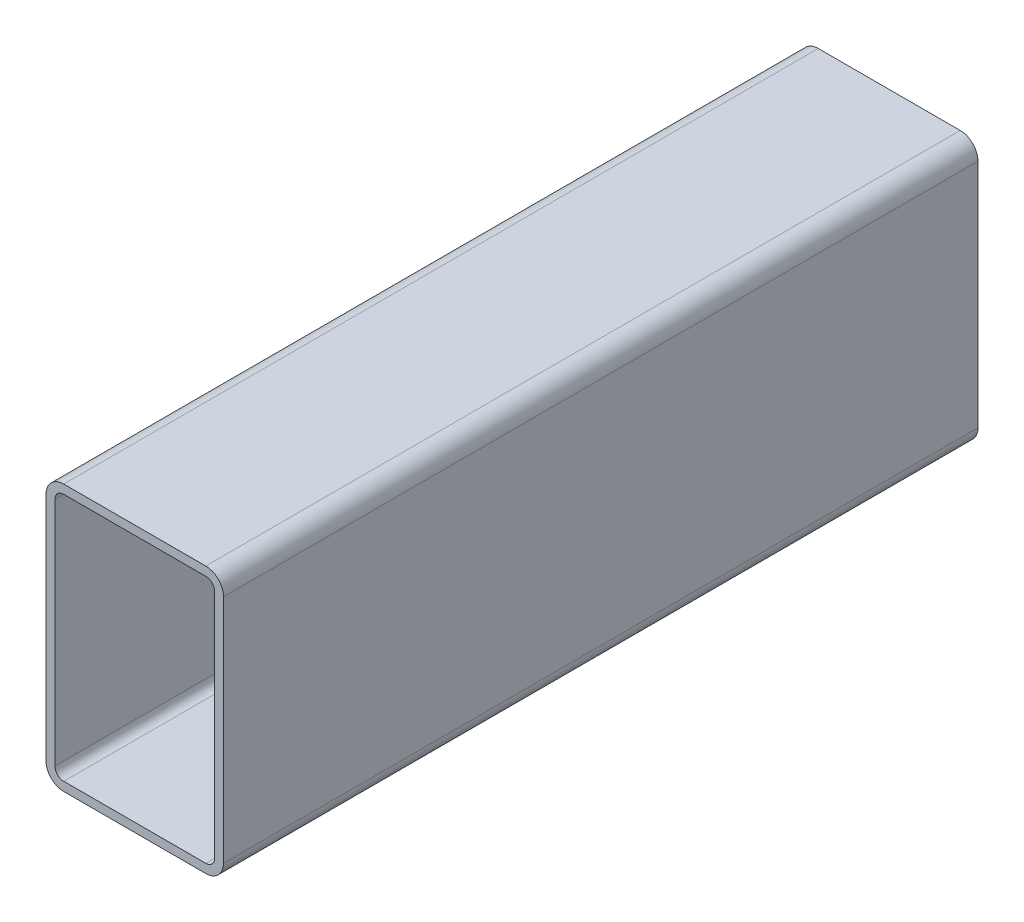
ISO-10303-21;
HEADER;
FILE_DESCRIPTION(('STEP AP214'),'2;1');
FILE_NAME('part.step','',(''),(''),'','','');
FILE_SCHEMA(('AUTOMOTIVE_DESIGN { 1 0 10303 214 1 1 1 1 }'));
ENDSEC;
DATA;
#1=APPLICATION_CONTEXT('core data for automotive mechanical design processes');
#2=APPLICATION_PROTOCOL_DEFINITION('international standard','automotive_design',2000,#1);
#3=PRODUCT_CONTEXT('',#1,'mechanical');
#4=PRODUCT('Part','Part','',(#3));
#5=PRODUCT_RELATED_PRODUCT_CATEGORY('part','',(#4));
#6=PRODUCT_DEFINITION_FORMATION('','',#4);
#7=PRODUCT_DEFINITION_CONTEXT('part definition',#1,'design');
#8=PRODUCT_DEFINITION('design','',#6,#7);
#9=PRODUCT_DEFINITION_SHAPE('','',#8);
#10=(LENGTH_UNIT() NAMED_UNIT(*) SI_UNIT(.MILLI.,.METRE.));
#11=(NAMED_UNIT(*) PLANE_ANGLE_UNIT() SI_UNIT($,.RADIAN.));
#12=(NAMED_UNIT(*) SI_UNIT($,.STERADIAN.) SOLID_ANGLE_UNIT());
#13=UNCERTAINTY_MEASURE_WITH_UNIT(LENGTH_MEASURE(1.E-05),#10,'distance_accuracy_value','');
#14=(GEOMETRIC_REPRESENTATION_CONTEXT(3) GLOBAL_UNCERTAINTY_ASSIGNED_CONTEXT((#13)) GLOBAL_UNIT_ASSIGNED_CONTEXT((#10,
#11,#12)) REPRESENTATION_CONTEXT('',''));
#15=CARTESIAN_POINT('',(0.,0.,0.));
#16=DIRECTION('',(0.,0.,1.));
#17=DIRECTION('',(1.,0.,0.));
#18=AXIS2_PLACEMENT_3D('',#15,#16,#17);
#19=CARTESIAN_POINT('',(16.,26.,85.));
#20=DIRECTION('',(0.,0.,1.));
#21=DIRECTION('',(1.,0.,0.));
#22=AXIS2_PLACEMENT_3D('',#19,#20,#21);
#23=PLANE('',#22);
#24=CARTESIAN_POINT('',(16.,26.,85.));
#25=DIRECTION('',(0.,0.,1.));
#26=DIRECTION('',(1.,0.,0.));
#27=AXIS2_PLACEMENT_3D('',#24,#25,#26);
#28=CIRCLE('',#27,4.00000000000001);
#29=CARTESIAN_POINT('',(20.,26.,85.));
#30=VERTEX_POINT('',#29);
#31=CARTESIAN_POINT('',(16.,30.,85.));
#32=VERTEX_POINT('',#31);
#33=EDGE_CURVE('E221',#30,#32,#28,.T.);
#34=ORIENTED_EDGE('',*,*,#33,.T.);
#35=DIRECTION('',(-1.,0.,0.));
#36=VECTOR('',#35,1.);
#37=CARTESIAN_POINT('',(16.,30.,85.));
#38=LINE('',#37,#36);
#39=CARTESIAN_POINT('',(-16.,30.,85.));
#40=VERTEX_POINT('',#39);
#41=EDGE_CURVE('E224',#32,#40,#38,.T.);
#42=ORIENTED_EDGE('',*,*,#41,.T.);
#43=CARTESIAN_POINT('',(-16.,26.,85.));
#44=DIRECTION('',(0.,0.,1.));
#45=DIRECTION('',(-1.,0.,0.));
#46=AXIS2_PLACEMENT_3D('',#43,#44,#45);
#47=CIRCLE('',#46,4.00000000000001);
#48=CARTESIAN_POINT('',(-20.,26.,85.));
#49=VERTEX_POINT('',#48);
#50=EDGE_CURVE('E226',#40,#49,#47,.T.);
#51=ORIENTED_EDGE('',*,*,#50,.T.);
#52=DIRECTION('',(0.,-1.,0.));
#53=VECTOR('',#52,1.);
#54=CARTESIAN_POINT('',(-20.,26.,85.));
#55=LINE('',#54,#53);
#56=CARTESIAN_POINT('',(-20.,-26.,85.));
#57=VERTEX_POINT('',#56);
#58=EDGE_CURVE('E228',#49,#57,#55,.T.);
#59=ORIENTED_EDGE('',*,*,#58,.T.);
#60=CARTESIAN_POINT('',(-16.,-26.,85.));
#61=DIRECTION('',(0.,0.,1.));
#62=DIRECTION('',(1.,0.,0.));
#63=AXIS2_PLACEMENT_3D('',#60,#61,#62);
#64=CIRCLE('',#63,4.00000000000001);
#65=CARTESIAN_POINT('',(-16.,-30.,85.));
#66=VERTEX_POINT('',#65);
#67=EDGE_CURVE('E230',#57,#66,#64,.T.);
#68=ORIENTED_EDGE('',*,*,#67,.T.);
#69=DIRECTION('',(1.,0.,0.));
#70=VECTOR('',#69,1.);
#71=CARTESIAN_POINT('',(16.,-30.,85.));
#72=LINE('',#71,#70);
#73=CARTESIAN_POINT('',(16.,-30.,85.));
#74=VERTEX_POINT('',#73);
#75=EDGE_CURVE('E232',#66,#74,#72,.T.);
#76=ORIENTED_EDGE('',*,*,#75,.T.);
#77=CARTESIAN_POINT('',(16.,-26.,85.));
#78=DIRECTION('',(0.,0.,1.));
#79=DIRECTION('',(1.,0.,0.));
#80=AXIS2_PLACEMENT_3D('',#77,#78,#79);
#81=CIRCLE('',#80,4.00000000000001);
#82=CARTESIAN_POINT('',(20.,-26.,85.));
#83=VERTEX_POINT('',#82);
#84=EDGE_CURVE('E234',#74,#83,#81,.T.);
#85=ORIENTED_EDGE('',*,*,#84,.T.);
#86=DIRECTION('',(0.,1.,0.));
#87=VECTOR('',#86,1.);
#88=CARTESIAN_POINT('',(20.,26.,85.));
#89=LINE('',#88,#87);
#90=EDGE_CURVE('E236',#83,#30,#89,.T.);
#91=ORIENTED_EDGE('',*,*,#90,.T.);
#92=EDGE_LOOP('',(#34,#42,#51,#59,#68,#76,#85,#91));
#93=FACE_BOUND('',#92,.T.);
#94=DIRECTION('',(-1.,0.,0.));
#95=VECTOR('',#94,1.);
#96=CARTESIAN_POINT('',(16.,28.,85.));
#97=LINE('',#96,#95);
#98=CARTESIAN_POINT('',(16.,28.,85.));
#99=VERTEX_POINT('',#98);
#100=CARTESIAN_POINT('',(-16.,28.,85.));
#101=VERTEX_POINT('',#100);
#102=EDGE_CURVE('E179',#99,#101,#97,.T.);
#103=ORIENTED_EDGE('',*,*,#102,.F.);
#104=CARTESIAN_POINT('',(16.,26.,85.));
#105=DIRECTION('',(0.,0.,1.));
#106=DIRECTION('',(1.,0.,0.));
#107=AXIS2_PLACEMENT_3D('',#104,#105,#106);
#108=CIRCLE('',#107,2.00000000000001);
#109=CARTESIAN_POINT('',(18.,26.,85.));
#110=VERTEX_POINT('',#109);
#111=EDGE_CURVE('E156',#110,#99,#108,.T.);
#112=ORIENTED_EDGE('',*,*,#111,.F.);
#113=DIRECTION('',(0.,1.,0.));
#114=VECTOR('',#113,1.);
#115=CARTESIAN_POINT('',(18.,26.,85.));
#116=LINE('',#115,#114);
#117=CARTESIAN_POINT('',(18.,-26.,85.));
#118=VERTEX_POINT('',#117);
#119=EDGE_CURVE('E191',#118,#110,#116,.T.);
#120=ORIENTED_EDGE('',*,*,#119,.F.);
#121=CARTESIAN_POINT('',(16.,-26.,85.));
#122=DIRECTION('',(0.,0.,1.));
#123=DIRECTION('',(1.,0.,0.));
#124=AXIS2_PLACEMENT_3D('',#121,#122,#123);
#125=CIRCLE('',#124,2.00000000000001);
#126=CARTESIAN_POINT('',(16.,-28.,85.));
#127=VERTEX_POINT('',#126);
#128=EDGE_CURVE('E189',#127,#118,#125,.T.);
#129=ORIENTED_EDGE('',*,*,#128,.F.);
#130=DIRECTION('',(1.,0.,0.));
#131=VECTOR('',#130,1.);
#132=CARTESIAN_POINT('',(16.,-28.,85.));
#133=LINE('',#132,#131);
#134=CARTESIAN_POINT('',(-16.,-28.,85.));
#135=VERTEX_POINT('',#134);
#136=EDGE_CURVE('E187',#135,#127,#133,.T.);
#137=ORIENTED_EDGE('',*,*,#136,.F.);
#138=CARTESIAN_POINT('',(-16.,-26.,85.));
#139=DIRECTION('',(0.,0.,1.));
#140=DIRECTION('',(1.,0.,0.));
#141=AXIS2_PLACEMENT_3D('',#138,#139,#140);
#142=CIRCLE('',#141,2.00000000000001);
#143=CARTESIAN_POINT('',(-18.,-26.,85.));
#144=VERTEX_POINT('',#143);
#145=EDGE_CURVE('E185',#144,#135,#142,.T.);
#146=ORIENTED_EDGE('',*,*,#145,.F.);
#147=DIRECTION('',(0.,-1.,0.));
#148=VECTOR('',#147,1.);
#149=CARTESIAN_POINT('',(-18.,26.,85.));
#150=LINE('',#149,#148);
#151=CARTESIAN_POINT('',(-18.,26.,85.));
#152=VERTEX_POINT('',#151);
#153=EDGE_CURVE('E183',#152,#144,#150,.T.);
#154=ORIENTED_EDGE('',*,*,#153,.F.);
#155=CARTESIAN_POINT('',(-16.,26.,85.));
#156=DIRECTION('',(0.,0.,1.));
#157=DIRECTION('',(1.,0.,0.));
#158=AXIS2_PLACEMENT_3D('',#155,#156,#157);
#159=CIRCLE('',#158,2.00000000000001);
#160=EDGE_CURVE('E181',#101,#152,#159,.T.);
#161=ORIENTED_EDGE('',*,*,#160,.F.);
#162=EDGE_LOOP('',(#103,#112,#120,#129,#137,#146,#154,#161));
#163=FACE_BOUND('',#162,.T.);
#164=ADVANCED_FACE('F28',(#93,#163),#23,.T.);
#165=CARTESIAN_POINT('',(16.,26.,-85.));
#166=DIRECTION('',(0.,0.,1.));
#167=DIRECTION('',(1.,0.,0.));
#168=AXIS2_PLACEMENT_3D('',#165,#166,#167);
#169=PLANE('',#168);
#170=CARTESIAN_POINT('',(16.,26.,-85.));
#171=DIRECTION('',(0.,0.,1.));
#172=DIRECTION('',(1.,0.,0.));
#173=AXIS2_PLACEMENT_3D('',#170,#171,#172);
#174=CIRCLE('',#173,4.00000000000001);
#175=CARTESIAN_POINT('',(20.,26.,-85.));
#176=VERTEX_POINT('',#175);
#177=CARTESIAN_POINT('',(16.,30.,-85.));
#178=VERTEX_POINT('',#177);
#179=EDGE_CURVE('E157',#176,#178,#174,.T.);
#180=ORIENTED_EDGE('',*,*,#179,.F.);
#181=DIRECTION('',(0.,1.,0.));
#182=VECTOR('',#181,1.);
#183=CARTESIAN_POINT('',(20.,26.,-85.));
#184=LINE('',#183,#182);
#185=CARTESIAN_POINT('',(20.,-26.,-85.));
#186=VERTEX_POINT('',#185);
#187=EDGE_CURVE('E219',#186,#176,#184,.T.);
#188=ORIENTED_EDGE('',*,*,#187,.F.);
#189=CARTESIAN_POINT('',(16.,-26.,-85.));
#190=DIRECTION('',(0.,0.,1.));
#191=DIRECTION('',(1.,0.,0.));
#192=AXIS2_PLACEMENT_3D('',#189,#190,#191);
#193=CIRCLE('',#192,4.00000000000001);
#194=CARTESIAN_POINT('',(16.,-30.,-85.));
#195=VERTEX_POINT('',#194);
#196=EDGE_CURVE('E217',#195,#186,#193,.T.);
#197=ORIENTED_EDGE('',*,*,#196,.F.);
#198=DIRECTION('',(1.,0.,0.));
#199=VECTOR('',#198,1.);
#200=CARTESIAN_POINT('',(16.,-30.,-85.));
#201=LINE('',#200,#199);
#202=CARTESIAN_POINT('',(-16.,-30.,-85.));
#203=VERTEX_POINT('',#202);
#204=EDGE_CURVE('E215',#203,#195,#201,.T.);
#205=ORIENTED_EDGE('',*,*,#204,.F.);
#206=CARTESIAN_POINT('',(-16.,-26.,-85.));
#207=DIRECTION('',(0.,0.,1.));
#208=DIRECTION('',(1.,0.,0.));
#209=AXIS2_PLACEMENT_3D('',#206,#207,#208);
#210=CIRCLE('',#209,4.00000000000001);
#211=CARTESIAN_POINT('',(-20.,-26.,-85.));
#212=VERTEX_POINT('',#211);
#213=EDGE_CURVE('E213',#212,#203,#210,.T.);
#214=ORIENTED_EDGE('',*,*,#213,.F.);
#215=DIRECTION('',(0.,-1.,0.));
#216=VECTOR('',#215,1.);
#217=CARTESIAN_POINT('',(-20.,26.,-85.));
#218=LINE('',#217,#216);
#219=CARTESIAN_POINT('',(-20.,26.,-85.));
#220=VERTEX_POINT('',#219);
#221=EDGE_CURVE('E211',#220,#212,#218,.T.);
#222=ORIENTED_EDGE('',*,*,#221,.F.);
#223=CARTESIAN_POINT('',(-16.,26.,-85.));
#224=DIRECTION('',(0.,0.,1.));
#225=DIRECTION('',(-1.,0.,0.));
#226=AXIS2_PLACEMENT_3D('',#223,#224,#225);
#227=CIRCLE('',#226,4.00000000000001);
#228=CARTESIAN_POINT('',(-16.,30.,-85.));
#229=VERTEX_POINT('',#228);
#230=EDGE_CURVE('E209',#229,#220,#227,.T.);
#231=ORIENTED_EDGE('',*,*,#230,.F.);
#232=DIRECTION('',(-1.,0.,0.));
#233=VECTOR('',#232,1.);
#234=CARTESIAN_POINT('',(16.,30.,-85.));
#235=LINE('',#234,#233);
#236=EDGE_CURVE('E207',#178,#229,#235,.T.);
#237=ORIENTED_EDGE('',*,*,#236,.F.);
#238=EDGE_LOOP('',(#180,#188,#197,#205,#214,#222,#231,#237));
#239=FACE_BOUND('',#238,.T.);
#240=CARTESIAN_POINT('',(16.,26.,-85.));
#241=DIRECTION('',(0.,0.,1.));
#242=DIRECTION('',(1.,0.,0.));
#243=AXIS2_PLACEMENT_3D('',#240,#241,#242);
#244=CIRCLE('',#243,2.00000000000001);
#245=CARTESIAN_POINT('',(18.,26.,-85.));
#246=VERTEX_POINT('',#245);
#247=CARTESIAN_POINT('',(16.,28.,-85.));
#248=VERTEX_POINT('',#247);
#249=EDGE_CURVE('E51',#246,#248,#244,.T.);
#250=ORIENTED_EDGE('',*,*,#249,.T.);
#251=DIRECTION('',(-1.,0.,0.));
#252=VECTOR('',#251,1.);
#253=CARTESIAN_POINT('',(16.,28.,-85.));
#254=LINE('',#253,#252);
#255=CARTESIAN_POINT('',(-16.,28.,-85.));
#256=VERTEX_POINT('',#255);
#257=EDGE_CURVE('E143',#248,#256,#254,.T.);
#258=ORIENTED_EDGE('',*,*,#257,.T.);
#259=CARTESIAN_POINT('',(-16.,26.,-85.));
#260=DIRECTION('',(0.,0.,1.));
#261=DIRECTION('',(1.,0.,0.));
#262=AXIS2_PLACEMENT_3D('',#259,#260,#261);
#263=CIRCLE('',#262,2.00000000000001);
#264=CARTESIAN_POINT('',(-18.,26.,-85.));
#265=VERTEX_POINT('',#264);
#266=EDGE_CURVE('E152',#256,#265,#263,.T.);
#267=ORIENTED_EDGE('',*,*,#266,.T.);
#268=DIRECTION('',(0.,-1.,0.));
#269=VECTOR('',#268,1.);
#270=CARTESIAN_POINT('',(-18.,26.,-85.));
#271=LINE('',#270,#269);
#272=CARTESIAN_POINT('',(-18.,-26.,-85.));
#273=VERTEX_POINT('',#272);
#274=EDGE_CURVE('E166',#265,#273,#271,.T.);
#275=ORIENTED_EDGE('',*,*,#274,.T.);
#276=CARTESIAN_POINT('',(-16.,-26.,-85.));
#277=DIRECTION('',(0.,0.,1.));
#278=DIRECTION('',(1.,0.,0.));
#279=AXIS2_PLACEMENT_3D('',#276,#277,#278);
#280=CIRCLE('',#279,2.00000000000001);
#281=CARTESIAN_POINT('',(-16.,-28.,-85.));
#282=VERTEX_POINT('',#281);
#283=EDGE_CURVE('E169',#273,#282,#280,.T.);
#284=ORIENTED_EDGE('',*,*,#283,.T.);
#285=DIRECTION('',(1.,0.,0.));
#286=VECTOR('',#285,1.);
#287=CARTESIAN_POINT('',(16.,-28.,-85.));
#288=LINE('',#287,#286);
#289=CARTESIAN_POINT('',(16.,-28.,-85.));
#290=VERTEX_POINT('',#289);
#291=EDGE_CURVE('E172',#282,#290,#288,.T.);
#292=ORIENTED_EDGE('',*,*,#291,.T.);
#293=CARTESIAN_POINT('',(16.,-26.,-85.));
#294=DIRECTION('',(0.,0.,1.));
#295=DIRECTION('',(1.,0.,0.));
#296=AXIS2_PLACEMENT_3D('',#293,#294,#295);
#297=CIRCLE('',#296,2.00000000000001);
#298=CARTESIAN_POINT('',(18.,-26.,-85.));
#299=VERTEX_POINT('',#298);
#300=EDGE_CURVE('E175',#290,#299,#297,.T.);
#301=ORIENTED_EDGE('',*,*,#300,.T.);
#302=DIRECTION('',(0.,1.,0.));
#303=VECTOR('',#302,1.);
#304=CARTESIAN_POINT('',(18.,26.,-85.));
#305=LINE('',#304,#303);
#306=EDGE_CURVE('E162',#299,#246,#305,.T.);
#307=ORIENTED_EDGE('',*,*,#306,.T.);
#308=EDGE_LOOP('',(#250,#258,#267,#275,#284,#292,#301,#307));
#309=FACE_BOUND('',#308,.T.);
#310=ADVANCED_FACE('F160',(#239,#309),#169,.F.);
#311=CARTESIAN_POINT('',(16.,26.,85.));
#312=DIRECTION('',(0.,0.,-1.));
#313=DIRECTION('',(-1.,0.,0.));
#314=AXIS2_PLACEMENT_3D('',#311,#312,#313);
#315=CYLINDRICAL_SURFACE('',#314,4.00000000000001);
#316=ORIENTED_EDGE('',*,*,#179,.T.);
#317=DIRECTION('',(0.,0.,-1.));
#318=VECTOR('',#317,1.);
#319=CARTESIAN_POINT('',(16.,30.,85.));
#320=LINE('',#319,#318);
#321=EDGE_CURVE('E11',#32,#178,#320,.T.);
#322=ORIENTED_EDGE('',*,*,#321,.F.);
#323=ORIENTED_EDGE('',*,*,#33,.F.);
#324=DIRECTION('',(0.,0.,-1.));
#325=VECTOR('',#324,1.);
#326=CARTESIAN_POINT('',(20.,26.,85.));
#327=LINE('',#326,#325);
#328=EDGE_CURVE('E238',#30,#176,#327,.T.);
#329=ORIENTED_EDGE('',*,*,#328,.T.);
#330=EDGE_LOOP('',(#316,#322,#323,#329));
#331=FACE_BOUND('',#330,.T.);
#332=ADVANCED_FACE('F30',(#331),#315,.T.);
#333=CARTESIAN_POINT('',(16.,30.,85.));
#334=DIRECTION('',(0.,-1.,0.));
#335=DIRECTION('',(1.,0.,0.));
#336=AXIS2_PLACEMENT_3D('',#333,#334,#335);
#337=PLANE('',#336);
#338=ORIENTED_EDGE('',*,*,#236,.T.);
#339=DIRECTION('',(0.,0.,-1.));
#340=VECTOR('',#339,1.);
#341=CARTESIAN_POINT('',(-16.,30.,85.));
#342=LINE('',#341,#340);
#343=EDGE_CURVE('E36',#40,#229,#342,.T.);
#344=ORIENTED_EDGE('',*,*,#343,.F.);
#345=ORIENTED_EDGE('',*,*,#41,.F.);
#346=ORIENTED_EDGE('',*,*,#321,.T.);
#347=EDGE_LOOP('',(#338,#344,#345,#346));
#348=FACE_BOUND('',#347,.T.);
#349=ADVANCED_FACE('F282',(#348),#337,.F.);
#350=CARTESIAN_POINT('',(-16.,26.,85.));
#351=DIRECTION('',(0.,0.,-1.));
#352=DIRECTION('',(-1.,0.,0.));
#353=AXIS2_PLACEMENT_3D('',#350,#351,#352);
#354=CYLINDRICAL_SURFACE('',#353,4.00000000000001);
#355=ORIENTED_EDGE('',*,*,#230,.T.);
#356=DIRECTION('',(0.,0.,-1.));
#357=VECTOR('',#356,1.);
#358=CARTESIAN_POINT('',(-20.,26.,85.));
#359=LINE('',#358,#357);
#360=EDGE_CURVE('E253',#49,#220,#359,.T.);
#361=ORIENTED_EDGE('',*,*,#360,.F.);
#362=ORIENTED_EDGE('',*,*,#50,.F.);
#363=ORIENTED_EDGE('',*,*,#343,.T.);
#364=EDGE_LOOP('',(#355,#361,#362,#363));
#365=FACE_BOUND('',#364,.T.);
#366=ADVANCED_FACE('F260',(#365),#354,.T.);
#367=CARTESIAN_POINT('',(-20.,26.,85.));
#368=DIRECTION('',(1.,0.,0.));
#369=DIRECTION('',(0.,0.,-1.));
#370=AXIS2_PLACEMENT_3D('',#367,#368,#369);
#371=PLANE('',#370);
#372=ORIENTED_EDGE('',*,*,#221,.T.);
#373=DIRECTION('',(0.,0.,-1.));
#374=VECTOR('',#373,1.);
#375=CARTESIAN_POINT('',(-20.,-26.,85.));
#376=LINE('',#375,#374);
#377=EDGE_CURVE('E250',#57,#212,#376,.T.);
#378=ORIENTED_EDGE('',*,*,#377,.F.);
#379=ORIENTED_EDGE('',*,*,#58,.F.);
#380=ORIENTED_EDGE('',*,*,#360,.T.);
#381=EDGE_LOOP('',(#372,#378,#379,#380));
#382=FACE_BOUND('',#381,.T.);
#383=ADVANCED_FACE('F270',(#382),#371,.F.);
#384=CARTESIAN_POINT('',(-16.,-26.,85.));
#385=DIRECTION('',(0.,0.,-1.));
#386=DIRECTION('',(-1.,0.,0.));
#387=AXIS2_PLACEMENT_3D('',#384,#385,#386);
#388=CYLINDRICAL_SURFACE('',#387,4.00000000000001);
#389=ORIENTED_EDGE('',*,*,#213,.T.);
#390=DIRECTION('',(0.,0.,-1.));
#391=VECTOR('',#390,1.);
#392=CARTESIAN_POINT('',(-16.,-30.,85.));
#393=LINE('',#392,#391);
#394=EDGE_CURVE('E247',#66,#203,#393,.T.);
#395=ORIENTED_EDGE('',*,*,#394,.F.);
#396=ORIENTED_EDGE('',*,*,#67,.F.);
#397=ORIENTED_EDGE('',*,*,#377,.T.);
#398=EDGE_LOOP('',(#389,#395,#396,#397));
#399=FACE_BOUND('',#398,.T.);
#400=ADVANCED_FACE('F274',(#399),#388,.T.);
#401=CARTESIAN_POINT('',(16.,-30.,85.));
#402=DIRECTION('',(0.,1.,0.));
#403=DIRECTION('',(-1.,0.,0.));
#404=AXIS2_PLACEMENT_3D('',#401,#402,#403);
#405=PLANE('',#404);
#406=ORIENTED_EDGE('',*,*,#204,.T.);
#407=DIRECTION('',(0.,0.,-1.));
#408=VECTOR('',#407,1.);
#409=CARTESIAN_POINT('',(16.,-30.,85.));
#410=LINE('',#409,#408);
#411=EDGE_CURVE('E244',#74,#195,#410,.T.);
#412=ORIENTED_EDGE('',*,*,#411,.F.);
#413=ORIENTED_EDGE('',*,*,#75,.F.);
#414=ORIENTED_EDGE('',*,*,#394,.T.);
#415=EDGE_LOOP('',(#406,#412,#413,#414));
#416=FACE_BOUND('',#415,.T.);
#417=ADVANCED_FACE('F295',(#416),#405,.F.);
#418=CARTESIAN_POINT('',(16.,-26.,85.));
#419=DIRECTION('',(0.,0.,-1.));
#420=DIRECTION('',(-1.,0.,0.));
#421=AXIS2_PLACEMENT_3D('',#418,#419,#420);
#422=CYLINDRICAL_SURFACE('',#421,4.00000000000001);
#423=ORIENTED_EDGE('',*,*,#196,.T.);
#424=DIRECTION('',(0.,0.,-1.));
#425=VECTOR('',#424,1.);
#426=CARTESIAN_POINT('',(20.,-26.,85.));
#427=LINE('',#426,#425);
#428=EDGE_CURVE('E241',#83,#186,#427,.T.);
#429=ORIENTED_EDGE('',*,*,#428,.F.);
#430=ORIENTED_EDGE('',*,*,#84,.F.);
#431=ORIENTED_EDGE('',*,*,#411,.T.);
#432=EDGE_LOOP('',(#423,#429,#430,#431));
#433=FACE_BOUND('',#432,.T.);
#434=ADVANCED_FACE('F293',(#433),#422,.T.);
#435=CARTESIAN_POINT('',(20.,26.,85.));
#436=DIRECTION('',(-1.,0.,0.));
#437=DIRECTION('',(0.,0.,1.));
#438=AXIS2_PLACEMENT_3D('',#435,#436,#437);
#439=PLANE('',#438);
#440=ORIENTED_EDGE('',*,*,#187,.T.);
#441=ORIENTED_EDGE('',*,*,#328,.F.);
#442=ORIENTED_EDGE('',*,*,#90,.F.);
#443=ORIENTED_EDGE('',*,*,#428,.T.);
#444=EDGE_LOOP('',(#440,#441,#442,#443));
#445=FACE_BOUND('',#444,.T.);
#446=ADVANCED_FACE('F288',(#445),#439,.F.);
#447=CARTESIAN_POINT('',(16.,26.,85.));
#448=DIRECTION('',(0.,0.,-1.));
#449=DIRECTION('',(-1.,0.,0.));
#450=AXIS2_PLACEMENT_3D('',#447,#448,#449);
#451=CYLINDRICAL_SURFACE('',#450,2.00000000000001);
#452=ORIENTED_EDGE('',*,*,#249,.F.);
#453=DIRECTION('',(0.,0.,-1.));
#454=VECTOR('',#453,1.);
#455=CARTESIAN_POINT('',(18.,26.,85.));
#456=LINE('',#455,#454);
#457=EDGE_CURVE('E193',#110,#246,#456,.T.);
#458=ORIENTED_EDGE('',*,*,#457,.F.);
#459=ORIENTED_EDGE('',*,*,#111,.T.);
#460=DIRECTION('',(0.,0.,-1.));
#461=VECTOR('',#460,1.);
#462=CARTESIAN_POINT('',(16.,28.,85.));
#463=LINE('',#462,#461);
#464=EDGE_CURVE('E145',#99,#248,#463,.T.);
#465=ORIENTED_EDGE('',*,*,#464,.T.);
#466=EDGE_LOOP('',(#452,#458,#459,#465));
#467=FACE_BOUND('',#466,.T.);
#468=ADVANCED_FACE('F154',(#467),#451,.F.);
#469=CARTESIAN_POINT('',(16.,28.,85.));
#470=DIRECTION('',(0.,-1.,0.));
#471=DIRECTION('',(1.,0.,0.));
#472=AXIS2_PLACEMENT_3D('',#469,#470,#471);
#473=PLANE('',#472);
#474=ORIENTED_EDGE('',*,*,#257,.F.);
#475=ORIENTED_EDGE('',*,*,#464,.F.);
#476=ORIENTED_EDGE('',*,*,#102,.T.);
#477=DIRECTION('',(0.,0.,-1.));
#478=VECTOR('',#477,1.);
#479=CARTESIAN_POINT('',(-16.,28.,85.));
#480=LINE('',#479,#478);
#481=EDGE_CURVE('E148',#101,#256,#480,.T.);
#482=ORIENTED_EDGE('',*,*,#481,.T.);
#483=EDGE_LOOP('',(#474,#475,#476,#482));
#484=FACE_BOUND('',#483,.T.);
#485=ADVANCED_FACE('F144',(#484),#473,.T.);
#486=CARTESIAN_POINT('',(-16.,26.,85.));
#487=DIRECTION('',(0.,0.,-1.));
#488=DIRECTION('',(-1.,0.,0.));
#489=AXIS2_PLACEMENT_3D('',#486,#487,#488);
#490=CYLINDRICAL_SURFACE('',#489,2.00000000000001);
#491=ORIENTED_EDGE('',*,*,#266,.F.);
#492=ORIENTED_EDGE('',*,*,#481,.F.);
#493=ORIENTED_EDGE('',*,*,#160,.T.);
#494=DIRECTION('',(0.,0.,-1.));
#495=VECTOR('',#494,1.);
#496=CARTESIAN_POINT('',(-18.,26.,85.));
#497=LINE('',#496,#495);
#498=EDGE_CURVE('E202',#152,#265,#497,.T.);
#499=ORIENTED_EDGE('',*,*,#498,.T.);
#500=EDGE_LOOP('',(#491,#492,#493,#499));
#501=FACE_BOUND('',#500,.T.);
#502=ADVANCED_FACE('F319',(#501),#490,.F.);
#503=CARTESIAN_POINT('',(-18.,26.,85.));
#504=DIRECTION('',(1.,0.,0.));
#505=DIRECTION('',(0.,0.,-1.));
#506=AXIS2_PLACEMENT_3D('',#503,#504,#505);
#507=PLANE('',#506);
#508=ORIENTED_EDGE('',*,*,#274,.F.);
#509=ORIENTED_EDGE('',*,*,#498,.F.);
#510=ORIENTED_EDGE('',*,*,#153,.T.);
#511=DIRECTION('',(0.,0.,-1.));
#512=VECTOR('',#511,1.);
#513=CARTESIAN_POINT('',(-18.,-26.,85.));
#514=LINE('',#513,#512);
#515=EDGE_CURVE('E200',#144,#273,#514,.T.);
#516=ORIENTED_EDGE('',*,*,#515,.T.);
#517=EDGE_LOOP('',(#508,#509,#510,#516));
#518=FACE_BOUND('',#517,.T.);
#519=ADVANCED_FACE('F324',(#518),#507,.T.);
#520=CARTESIAN_POINT('',(-16.,-26.,85.));
#521=DIRECTION('',(0.,0.,-1.));
#522=DIRECTION('',(-1.,0.,0.));
#523=AXIS2_PLACEMENT_3D('',#520,#521,#522);
#524=CYLINDRICAL_SURFACE('',#523,2.00000000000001);
#525=ORIENTED_EDGE('',*,*,#283,.F.);
#526=ORIENTED_EDGE('',*,*,#515,.F.);
#527=ORIENTED_EDGE('',*,*,#145,.T.);
#528=DIRECTION('',(0.,0.,-1.));
#529=VECTOR('',#528,1.);
#530=CARTESIAN_POINT('',(-16.,-28.,85.));
#531=LINE('',#530,#529);
#532=EDGE_CURVE('E198',#135,#282,#531,.T.);
#533=ORIENTED_EDGE('',*,*,#532,.T.);
#534=EDGE_LOOP('',(#525,#526,#527,#533));
#535=FACE_BOUND('',#534,.T.);
#536=ADVANCED_FACE('F328',(#535),#524,.F.);
#537=CARTESIAN_POINT('',(16.,-28.,85.));
#538=DIRECTION('',(0.,1.,0.));
#539=DIRECTION('',(-1.,0.,0.));
#540=AXIS2_PLACEMENT_3D('',#537,#538,#539);
#541=PLANE('',#540);
#542=ORIENTED_EDGE('',*,*,#291,.F.);
#543=ORIENTED_EDGE('',*,*,#532,.F.);
#544=ORIENTED_EDGE('',*,*,#136,.T.);
#545=DIRECTION('',(0.,0.,-1.));
#546=VECTOR('',#545,1.);
#547=CARTESIAN_POINT('',(16.,-28.,85.));
#548=LINE('',#547,#546);
#549=EDGE_CURVE('E196',#127,#290,#548,.T.);
#550=ORIENTED_EDGE('',*,*,#549,.T.);
#551=EDGE_LOOP('',(#542,#543,#544,#550));
#552=FACE_BOUND('',#551,.T.);
#553=ADVANCED_FACE('F332',(#552),#541,.T.);
#554=CARTESIAN_POINT('',(16.,-26.,85.));
#555=DIRECTION('',(0.,0.,-1.));
#556=DIRECTION('',(-1.,0.,0.));
#557=AXIS2_PLACEMENT_3D('',#554,#555,#556);
#558=CYLINDRICAL_SURFACE('',#557,2.00000000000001);
#559=ORIENTED_EDGE('',*,*,#300,.F.);
#560=ORIENTED_EDGE('',*,*,#549,.F.);
#561=ORIENTED_EDGE('',*,*,#128,.T.);
#562=DIRECTION('',(0.,0.,-1.));
#563=VECTOR('',#562,1.);
#564=CARTESIAN_POINT('',(18.,-26.,85.));
#565=LINE('',#564,#563);
#566=EDGE_CURVE('E43',#118,#299,#565,.T.);
#567=ORIENTED_EDGE('',*,*,#566,.T.);
#568=EDGE_LOOP('',(#559,#560,#561,#567));
#569=FACE_BOUND('',#568,.T.);
#570=ADVANCED_FACE('F336',(#569),#558,.F.);
#571=CARTESIAN_POINT('',(18.,26.,85.));
#572=DIRECTION('',(-1.,0.,0.));
#573=DIRECTION('',(0.,0.,1.));
#574=AXIS2_PLACEMENT_3D('',#571,#572,#573);
#575=PLANE('',#574);
#576=ORIENTED_EDGE('',*,*,#306,.F.);
#577=ORIENTED_EDGE('',*,*,#566,.F.);
#578=ORIENTED_EDGE('',*,*,#119,.T.);
#579=ORIENTED_EDGE('',*,*,#457,.T.);
#580=EDGE_LOOP('',(#576,#577,#578,#579));
#581=FACE_BOUND('',#580,.T.);
#582=ADVANCED_FACE('F340',(#581),#575,.T.);
#583=CLOSED_SHELL('',(#164,#310,#332,#349,#366,#383,#400,#417,#434,#446,#468,#485,#502,#519,
#536,#553,#570,#582));
#584=MANIFOLD_SOLID_BREP('B2',#583);
#585=ADVANCED_BREP_SHAPE_REPRESENTATION('',(#18,#584),#14);
#586=SHAPE_DEFINITION_REPRESENTATION(#9,#585);
ENDSEC;
END-ISO-10303-21;
